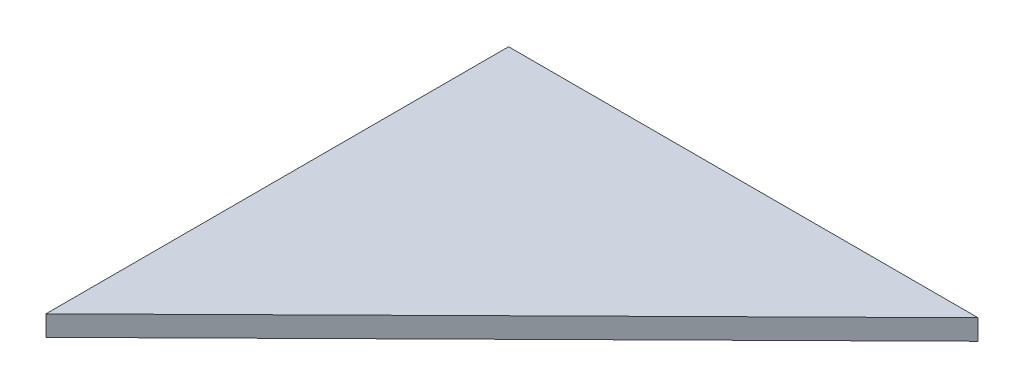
ISO-10303-21;
HEADER;
FILE_DESCRIPTION(('STEP AP214'),'2;1');
FILE_NAME('part.step','',(''),(''),'','','');
FILE_SCHEMA(('AUTOMOTIVE_DESIGN { 1 0 10303 214 1 1 1 1 }'));
ENDSEC;
DATA;
#1=APPLICATION_CONTEXT('core data for automotive mechanical design processes');
#2=APPLICATION_PROTOCOL_DEFINITION('international standard','automotive_design',2000,#1);
#3=PRODUCT_CONTEXT('',#1,'mechanical');
#4=PRODUCT('Part','Part','',(#3));
#5=PRODUCT_RELATED_PRODUCT_CATEGORY('part','',(#4));
#6=PRODUCT_DEFINITION_FORMATION('','',#4);
#7=PRODUCT_DEFINITION_CONTEXT('part definition',#1,'design');
#8=PRODUCT_DEFINITION('design','',#6,#7);
#9=PRODUCT_DEFINITION_SHAPE('','',#8);
#10=(LENGTH_UNIT() NAMED_UNIT(*) SI_UNIT(.MILLI.,.METRE.));
#11=(NAMED_UNIT(*) PLANE_ANGLE_UNIT() SI_UNIT($,.RADIAN.));
#12=(NAMED_UNIT(*) SI_UNIT($,.STERADIAN.) SOLID_ANGLE_UNIT());
#13=UNCERTAINTY_MEASURE_WITH_UNIT(LENGTH_MEASURE(1.E-05),#10,'distance_accuracy_value','');
#14=(GEOMETRIC_REPRESENTATION_CONTEXT(3) GLOBAL_UNCERTAINTY_ASSIGNED_CONTEXT((#13)) GLOBAL_UNIT_ASSIGNED_CONTEXT((#10,
#11,#12)) REPRESENTATION_CONTEXT('',''));
#15=CARTESIAN_POINT('',(0.,0.,0.));
#16=DIRECTION('',(0.,0.,1.));
#17=DIRECTION('',(1.,0.,0.));
#18=AXIS2_PLACEMENT_3D('',#15,#16,#17);
#19=CARTESIAN_POINT('',(69.,3.,0.));
#20=DIRECTION('',(0.,0.,1.));
#21=DIRECTION('',(1.,0.,0.));
#22=AXIS2_PLACEMENT_3D('',#19,#20,#21);
#23=PLANE('',#22);
#24=DIRECTION('',(-1.,0.,0.));
#25=VECTOR('',#24,1.);
#26=CARTESIAN_POINT('',(69.,0.,0.));
#27=LINE('',#26,#25);
#28=CARTESIAN_POINT('',(69.,0.,0.));
#29=VERTEX_POINT('',#28);
#30=CARTESIAN_POINT('',(0.,0.,0.));
#31=VERTEX_POINT('',#30);
#32=EDGE_CURVE('E66',#29,#31,#27,.T.);
#33=ORIENTED_EDGE('',*,*,#32,.T.);
#34=DIRECTION('',(0.,-1.,0.));
#35=VECTOR('',#34,1.);
#36=CARTESIAN_POINT('',(0.,3.,0.));
#37=LINE('',#36,#35);
#38=CARTESIAN_POINT('',(0.,3.,0.));
#39=VERTEX_POINT('',#38);
#40=EDGE_CURVE('E11',#39,#31,#37,.T.);
#41=ORIENTED_EDGE('',*,*,#40,.F.);
#42=DIRECTION('',(-1.,0.,0.));
#43=VECTOR('',#42,1.);
#44=CARTESIAN_POINT('',(69.,3.,0.));
#45=LINE('',#44,#43);
#46=CARTESIAN_POINT('',(69.,3.,0.));
#47=VERTEX_POINT('',#46);
#48=EDGE_CURVE('E80',#47,#39,#45,.T.);
#49=ORIENTED_EDGE('',*,*,#48,.F.);
#50=DIRECTION('',(0.,-1.,0.));
#51=VECTOR('',#50,1.);
#52=CARTESIAN_POINT('',(69.,3.,0.));
#53=LINE('',#52,#51);
#54=EDGE_CURVE('E76',#47,#29,#53,.T.);
#55=ORIENTED_EDGE('',*,*,#54,.T.);
#56=EDGE_LOOP('',(#33,#41,#49,#55));
#57=FACE_BOUND('',#56,.T.);
#58=ADVANCED_FACE('F30',(#57),#23,.F.);
#59=CARTESIAN_POINT('',(0.,3.,0.));
#60=DIRECTION('',(1.,0.,0.));
#61=DIRECTION('',(0.,0.,-1.));
#62=AXIS2_PLACEMENT_3D('',#59,#60,#61);
#63=PLANE('',#62);
#64=DIRECTION('',(0.,0.,1.));
#65=VECTOR('',#64,1.);
#66=CARTESIAN_POINT('',(0.,0.,0.));
#67=LINE('',#66,#65);
#68=CARTESIAN_POINT('',(0.,0.,68.));
#69=VERTEX_POINT('',#68);
#70=EDGE_CURVE('E63',#31,#69,#67,.T.);
#71=ORIENTED_EDGE('',*,*,#70,.T.);
#72=DIRECTION('',(0.,-1.,0.));
#73=VECTOR('',#72,1.);
#74=CARTESIAN_POINT('',(0.,3.,68.));
#75=LINE('',#74,#73);
#76=CARTESIAN_POINT('',(0.,3.,68.));
#77=VERTEX_POINT('',#76);
#78=EDGE_CURVE('E37',#77,#69,#75,.T.);
#79=ORIENTED_EDGE('',*,*,#78,.F.);
#80=DIRECTION('',(0.,0.,1.));
#81=VECTOR('',#80,1.);
#82=CARTESIAN_POINT('',(0.,3.,0.));
#83=LINE('',#82,#81);
#84=EDGE_CURVE('E48',#39,#77,#83,.T.);
#85=ORIENTED_EDGE('',*,*,#84,.F.);
#86=ORIENTED_EDGE('',*,*,#40,.T.);
#87=EDGE_LOOP('',(#71,#79,#85,#86));
#88=FACE_BOUND('',#87,.T.);
#89=ADVANCED_FACE('F72',(#88),#63,.F.);
#90=CARTESIAN_POINT('',(0.,3.,68.));
#91=DIRECTION('',(-0.701926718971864,0.,-0.71224917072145));
#92=DIRECTION('',(-0.71224917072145,0.,0.701926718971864));
#93=AXIS2_PLACEMENT_3D('',#90,#91,#92);
#94=PLANE('',#93);
#95=DIRECTION('',(0.71224917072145,0.,-0.701926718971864));
#96=VECTOR('',#95,1.);
#97=CARTESIAN_POINT('',(0.,0.,68.));
#98=LINE('',#97,#96);
#99=EDGE_CURVE('E67',#69,#29,#98,.T.);
#100=ORIENTED_EDGE('',*,*,#99,.T.);
#101=ORIENTED_EDGE('',*,*,#54,.F.);
#102=DIRECTION('',(0.71224917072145,0.,-0.701926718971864));
#103=VECTOR('',#102,1.);
#104=CARTESIAN_POINT('',(0.,3.,68.));
#105=LINE('',#104,#103);
#106=EDGE_CURVE('E44',#77,#47,#105,.T.);
#107=ORIENTED_EDGE('',*,*,#106,.F.);
#108=ORIENTED_EDGE('',*,*,#78,.T.);
#109=EDGE_LOOP('',(#100,#101,#107,#108));
#110=FACE_BOUND('',#109,.T.);
#111=ADVANCED_FACE('F85',(#110),#94,.F.);
#112=CARTESIAN_POINT('',(0.,3.,0.));
#113=DIRECTION('',(0.,1.,0.));
#114=DIRECTION('',(0.,0.,1.));
#115=AXIS2_PLACEMENT_3D('',#112,#113,#114);
#116=PLANE('',#115);
#117=ORIENTED_EDGE('',*,*,#48,.T.);
#118=ORIENTED_EDGE('',*,*,#84,.T.);
#119=ORIENTED_EDGE('',*,*,#106,.T.);
#120=EDGE_LOOP('',(#117,#118,#119));
#121=FACE_BOUND('',#120,.T.);
#122=ADVANCED_FACE('F86',(#121),#116,.T.);
#123=CARTESIAN_POINT('',(0.,0.,0.));
#124=DIRECTION('',(0.,1.,0.));
#125=DIRECTION('',(0.,0.,1.));
#126=AXIS2_PLACEMENT_3D('',#123,#124,#125);
#127=PLANE('',#126);
#128=ORIENTED_EDGE('',*,*,#32,.F.);
#129=ORIENTED_EDGE('',*,*,#99,.F.);
#130=ORIENTED_EDGE('',*,*,#70,.F.);
#131=EDGE_LOOP('',(#128,#129,#130));
#132=FACE_BOUND('',#131,.T.);
#133=ADVANCED_FACE('F64',(#132),#127,.F.);
#134=CLOSED_SHELL('',(#58,#89,#111,#122,#133));
#135=MANIFOLD_SOLID_BREP('B2',#134);
#136=ADVANCED_BREP_SHAPE_REPRESENTATION('',(#18,#135),#14);
#137=SHAPE_DEFINITION_REPRESENTATION(#9,#136);
ENDSEC;
END-ISO-10303-21;
